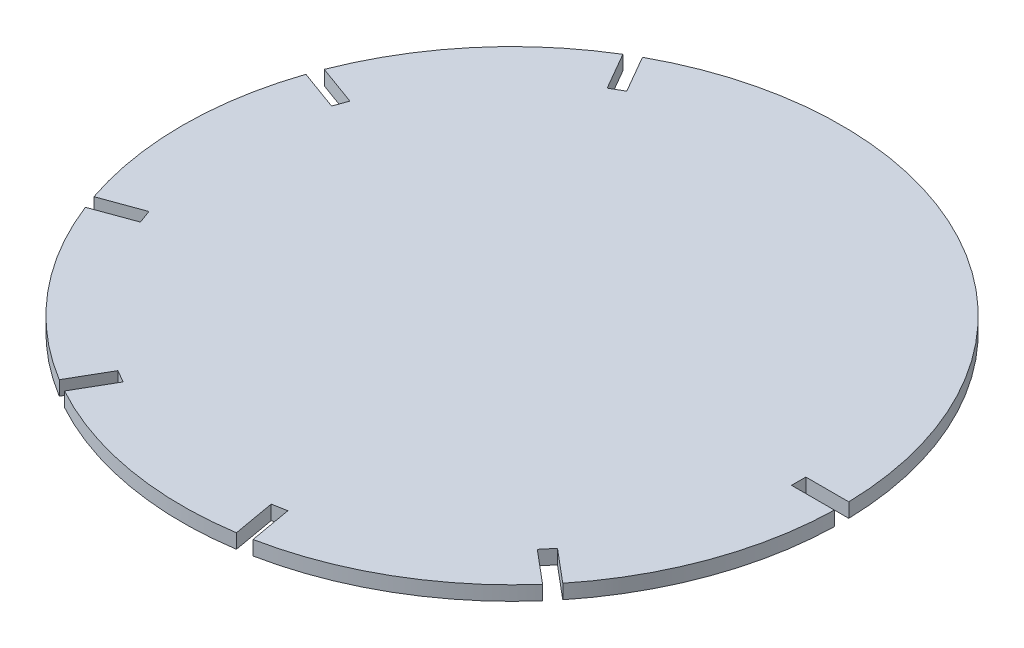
ISO-10303-21;
HEADER;
FILE_DESCRIPTION(('STEP AP214'),'2;1');
FILE_NAME('part.step','',(''),(''),'','','');
FILE_SCHEMA(('AUTOMOTIVE_DESIGN { 1 0 10303 214 1 1 1 1 }'));
ENDSEC;
DATA;
#1=APPLICATION_CONTEXT('core data for automotive mechanical design processes');
#2=APPLICATION_PROTOCOL_DEFINITION('international standard','automotive_design',2000,#1);
#3=PRODUCT_CONTEXT('',#1,'mechanical');
#4=PRODUCT('Part','Part','',(#3));
#5=PRODUCT_RELATED_PRODUCT_CATEGORY('part','',(#4));
#6=PRODUCT_DEFINITION_FORMATION('','',#4);
#7=PRODUCT_DEFINITION_CONTEXT('part definition',#1,'design');
#8=PRODUCT_DEFINITION('design','',#6,#7);
#9=PRODUCT_DEFINITION_SHAPE('','',#8);
#10=(LENGTH_UNIT() NAMED_UNIT(*) SI_UNIT(.MILLI.,.METRE.));
#11=(NAMED_UNIT(*) PLANE_ANGLE_UNIT() SI_UNIT($,.RADIAN.));
#12=(NAMED_UNIT(*) SI_UNIT($,.STERADIAN.) SOLID_ANGLE_UNIT());
#13=UNCERTAINTY_MEASURE_WITH_UNIT(LENGTH_MEASURE(1.E-05),#10,'distance_accuracy_value','');
#14=(GEOMETRIC_REPRESENTATION_CONTEXT(3) GLOBAL_UNCERTAINTY_ASSIGNED_CONTEXT((#13)) GLOBAL_UNIT_ASSIGNED_CONTEXT((#10,
#11,#12)) REPRESENTATION_CONTEXT('',''));
#15=CARTESIAN_POINT('',(0.,0.,0.));
#16=DIRECTION('',(0.,0.,1.));
#17=DIRECTION('',(1.,0.,0.));
#18=AXIS2_PLACEMENT_3D('',#15,#16,#17);
#19=CARTESIAN_POINT('',(0.,15.,0.));
#20=DIRECTION('',(0.,-1.,0.));
#21=DIRECTION('',(0.,0.,-1.));
#22=AXIS2_PLACEMENT_3D('',#19,#20,#21);
#23=CYLINDRICAL_SURFACE('',#22,345.);
#24=DIRECTION('',(0.,-1.,0.));
#25=VECTOR('',#24,1.);
#26=CARTESIAN_POINT('',(-165.964043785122,15.,302.458156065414));
#27=LINE('',#26,#25);
#28=CARTESIAN_POINT('',(-165.964043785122,0.,302.458156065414));
#29=VERTEX_POINT('',#28);
#30=CARTESIAN_POINT('',(-165.964043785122,15.,302.458156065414));
#31=VERTEX_POINT('',#30);
#32=EDGE_CURVE('E239',#29,#31,#27,.F.);
#33=ORIENTED_EDGE('',*,*,#32,.F.);
#34=CARTESIAN_POINT('',(0.,0.,0.));
#35=DIRECTION('',(0.,1.,0.));
#36=DIRECTION('',(0.,0.,1.));
#37=AXIS2_PLACEMENT_3D('',#34,#35,#36);
#38=CIRCLE('',#37,345.);
#39=CARTESIAN_POINT('',(52.5084053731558,0.,340.980743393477));
#40=VERTEX_POINT('',#39);
#41=EDGE_CURVE('E414',#29,#40,#38,.T.);
#42=ORIENTED_EDGE('',*,*,#41,.T.);
#43=DIRECTION('',(0.,-1.,0.));
#44=VECTOR('',#43,1.);
#45=CARTESIAN_POINT('',(52.5084053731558,15.,340.980743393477));
#46=LINE('',#45,#44);
#47=CARTESIAN_POINT('',(52.5084053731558,15.,340.980743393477));
#48=VERTEX_POINT('',#47);
#49=EDGE_CURVE('E368',#40,#48,#46,.F.);
#50=ORIENTED_EDGE('',*,*,#49,.T.);
#51=CARTESIAN_POINT('',(0.,15.,0.));
#52=DIRECTION('',(0.,1.,0.));
#53=DIRECTION('',(0.,0.,1.));
#54=AXIS2_PLACEMENT_3D('',#51,#52,#53);
#55=CIRCLE('',#54,345.);
#56=EDGE_CURVE('E42',#31,#48,#55,.T.);
#57=ORIENTED_EDGE('',*,*,#56,.F.);
#58=EDGE_LOOP('',(#33,#42,#50,#57));
#59=FACE_BOUND('',#58,.T.);
#60=ADVANCED_FACE('F33',(#59),#23,.T.);
#61=DIRECTION('',(0.,-1.,0.));
#62=VECTOR('',#61,1.);
#63=CARTESIAN_POINT('',(67.2805216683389,15.,338.376020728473));
#64=LINE('',#63,#62);
#65=CARTESIAN_POINT('',(67.2805216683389,0.,338.376020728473));
#66=VERTEX_POINT('',#65);
#67=CARTESIAN_POINT('',(67.2805216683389,15.,338.376020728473));
#68=VERTEX_POINT('',#67);
#69=EDGE_CURVE('E371',#66,#68,#64,.F.);
#70=ORIENTED_EDGE('',*,*,#69,.F.);
#71=CARTESIAN_POINT('',(259.401969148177,0.,227.454651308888));
#72=VERTEX_POINT('',#71);
#73=EDGE_CURVE('E419',#66,#72,#38,.T.);
#74=ORIENTED_EDGE('',*,*,#73,.T.);
#75=DIRECTION('',(0.,-1.,0.));
#76=VECTOR('',#75,1.);
#77=CARTESIAN_POINT('',(259.401969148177,15.,227.454651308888));
#78=LINE('',#77,#76);
#79=CARTESIAN_POINT('',(259.401969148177,15.,227.454651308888));
#80=VERTEX_POINT('',#79);
#81=EDGE_CURVE('E363',#72,#80,#78,.F.);
#82=ORIENTED_EDGE('',*,*,#81,.T.);
#83=EDGE_CURVE('E454',#68,#80,#55,.T.);
#84=ORIENTED_EDGE('',*,*,#83,.F.);
#85=EDGE_LOOP('',(#70,#74,#82,#84));
#86=FACE_BOUND('',#85,.T.);
#87=ADVANCED_FACE('F492',(#86),#23,.T.);
#88=DIRECTION('',(0.,-1.,0.));
#89=VECTOR('',#88,1.);
#90=CARTESIAN_POINT('',(269.043783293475,15.,215.963984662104));
#91=LINE('',#90,#89);
#92=CARTESIAN_POINT('',(269.043783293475,0.,215.963984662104));
#93=VERTEX_POINT('',#92);
#94=CARTESIAN_POINT('',(269.043783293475,15.,215.963984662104));
#95=VERTEX_POINT('',#94);
#96=EDGE_CURVE('E366',#93,#95,#91,.F.);
#97=ORIENTED_EDGE('',*,*,#96,.F.);
#98=CARTESIAN_POINT('',(344.918468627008,0.,7.5));
#99=VERTEX_POINT('',#98);
#100=EDGE_CURVE('E423',#93,#99,#38,.T.);
#101=ORIENTED_EDGE('',*,*,#100,.T.);
#102=DIRECTION('',(0.,-1.,0.));
#103=VECTOR('',#102,1.);
#104=CARTESIAN_POINT('',(344.918468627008,15.,7.5));
#105=LINE('',#104,#103);
#106=CARTESIAN_POINT('',(344.918468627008,15.,7.5));
#107=VERTEX_POINT('',#106);
#108=EDGE_CURVE('E358',#99,#107,#105,.F.);
#109=ORIENTED_EDGE('',*,*,#108,.T.);
#110=EDGE_CURVE('E452',#95,#107,#55,.T.);
#111=ORIENTED_EDGE('',*,*,#110,.F.);
#112=EDGE_LOOP('',(#97,#101,#109,#111));
#113=FACE_BOUND('',#112,.T.);
#114=ADVANCED_FACE('F505',(#113),#23,.T.);
#115=DIRECTION('',(0.,-1.,0.));
#116=VECTOR('',#115,1.);
#117=CARTESIAN_POINT('',(344.918468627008,15.,-7.5));
#118=LINE('',#117,#116);
#119=CARTESIAN_POINT('',(344.918468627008,0.,-7.5));
#120=VERTEX_POINT('',#119);
#121=CARTESIAN_POINT('',(344.918468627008,15.,-7.5));
#122=VERTEX_POINT('',#121);
#123=EDGE_CURVE('E361',#120,#122,#118,.F.);
#124=ORIENTED_EDGE('',*,*,#123,.F.);
#125=CARTESIAN_POINT('',(-165.964043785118,0.,-302.458156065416));
#126=VERTEX_POINT('',#125);
#127=EDGE_CURVE('E412',#120,#126,#38,.T.);
#128=ORIENTED_EDGE('',*,*,#127,.T.);
#129=DIRECTION('',(0.,-1.,0.));
#130=VECTOR('',#129,1.);
#131=CARTESIAN_POINT('',(-165.964043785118,15.,-302.458156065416));
#132=LINE('',#131,#130);
#133=CARTESIAN_POINT('',(-165.964043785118,15.,-302.458156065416));
#134=VERTEX_POINT('',#133);
#135=EDGE_CURVE('E58',#126,#134,#132,.F.);
#136=ORIENTED_EDGE('',*,*,#135,.T.);
#137=EDGE_CURVE('E449',#122,#134,#55,.T.);
#138=ORIENTED_EDGE('',*,*,#137,.F.);
#139=EDGE_LOOP('',(#124,#128,#136,#138));
#140=FACE_BOUND('',#139,.T.);
#141=ADVANCED_FACE('F435',(#140),#23,.T.);
#142=DIRECTION('',(0.,-1.,0.));
#143=VECTOR('',#142,1.);
#144=CARTESIAN_POINT('',(-326.682490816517,15.,-110.921369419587));
#145=LINE('',#144,#143);
#146=CARTESIAN_POINT('',(-326.682490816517,0.,-110.921369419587));
#147=VERTEX_POINT('',#146);
#148=CARTESIAN_POINT('',(-326.682490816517,15.,-110.921369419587));
#149=VERTEX_POINT('',#148);
#150=EDGE_CURVE('E356',#147,#149,#145,.F.);
#151=ORIENTED_EDGE('',*,*,#150,.F.);
#152=CARTESIAN_POINT('',(-326.682490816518,0.,110.921369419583));
#153=VERTEX_POINT('',#152);
#154=EDGE_CURVE('E402',#147,#153,#38,.T.);
#155=ORIENTED_EDGE('',*,*,#154,.T.);
#156=DIRECTION('',(0.,-1.,0.));
#157=VECTOR('',#156,1.);
#158=CARTESIAN_POINT('',(-326.682490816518,15.,110.921369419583));
#159=LINE('',#158,#157);
#160=CARTESIAN_POINT('',(-326.682490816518,15.,110.921369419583));
#161=VERTEX_POINT('',#160);
#162=EDGE_CURVE('E397',#153,#161,#159,.F.);
#163=ORIENTED_EDGE('',*,*,#162,.T.);
#164=EDGE_CURVE('E43',#149,#161,#55,.T.);
#165=ORIENTED_EDGE('',*,*,#164,.F.);
#166=EDGE_LOOP('',(#151,#155,#163,#165));
#167=FACE_BOUND('',#166,.T.);
#168=ADVANCED_FACE('F472',(#167),#23,.T.);
#169=CARTESIAN_POINT('',(-178.954424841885,0.,-294.958156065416));
#170=VERTEX_POINT('',#169);
#171=CARTESIAN_POINT('',(-321.552188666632,0.,-125.016758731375));
#172=VERTEX_POINT('',#171);
#173=EDGE_CURVE('E406',#170,#172,#38,.T.);
#174=ORIENTED_EDGE('',*,*,#173,.T.);
#175=DIRECTION('',(0.,-1.,0.));
#176=VECTOR('',#175,1.);
#177=CARTESIAN_POINT('',(-321.552188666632,15.,-125.016758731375));
#178=LINE('',#177,#176);
#179=CARTESIAN_POINT('',(-321.552188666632,15.,-125.016758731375));
#180=VERTEX_POINT('',#179);
#181=EDGE_CURVE('E50',#172,#180,#178,.F.);
#182=ORIENTED_EDGE('',*,*,#181,.T.);
#183=CARTESIAN_POINT('',(-178.954424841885,15.,-294.958156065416));
#184=VERTEX_POINT('',#183);
#185=EDGE_CURVE('E417',#184,#180,#55,.T.);
#186=ORIENTED_EDGE('',*,*,#185,.F.);
#187=DIRECTION('',(0.,-1.,0.));
#188=VECTOR('',#187,1.);
#189=CARTESIAN_POINT('',(-178.954424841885,15.,-294.958156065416));
#190=LINE('',#189,#188);
#191=EDGE_CURVE('E247',#170,#184,#190,.F.);
#192=ORIENTED_EDGE('',*,*,#191,.F.);
#193=EDGE_LOOP('',(#174,#182,#186,#192));
#194=FACE_BOUND('',#193,.T.);
#195=ADVANCED_FACE('F461',(#194),#23,.T.);
#196=CARTESIAN_POINT('',(0.,15.,0.));
#197=DIRECTION('',(0.,1.,0.));
#198=DIRECTION('',(0.,0.,1.));
#199=AXIS2_PLACEMENT_3D('',#196,#197,#198);
#200=PLANE('',#199);
#201=DIRECTION('',(-0.866025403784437,0.,-0.500000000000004));
#202=VECTOR('',#201,1.);
#203=CARTESIAN_POINT('',(-143.504809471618,15.,263.557621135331));
#204=LINE('',#203,#202);
#205=CARTESIAN_POINT('',(-143.504809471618,15.,263.557621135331));
#206=VERTEX_POINT('',#205);
#207=CARTESIAN_POINT('',(-156.495190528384,15.,256.057621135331));
#208=VERTEX_POINT('',#207);
#209=EDGE_CURVE('E226',#206,#208,#204,.T.);
#210=ORIENTED_EDGE('',*,*,#209,.F.);
#211=DIRECTION('',(-0.500000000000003,0.,0.866025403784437));
#212=VECTOR('',#211,1.);
#213=CARTESIAN_POINT('',(-143.504809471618,15.,263.557621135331));
#214=LINE('',#213,#212);
#215=EDGE_CURVE('E236',#206,#31,#214,.T.);
#216=ORIENTED_EDGE('',*,*,#215,.T.);
#217=ORIENTED_EDGE('',*,*,#56,.T.);
#218=DIRECTION('',(0.173648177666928,0.,0.984807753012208));
#219=VECTOR('',#218,1.);
#220=CARTESIAN_POINT('',(44.7083951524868,15.,296.744687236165));
#221=LINE('',#220,#219);
#222=CARTESIAN_POINT('',(44.7083951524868,15.,296.744687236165));
#223=VERTEX_POINT('',#222);
#224=EDGE_CURVE('E266',#223,#48,#221,.T.);
#225=ORIENTED_EDGE('',*,*,#224,.F.);
#226=DIRECTION('',(-0.984807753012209,0.,0.173648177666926));
#227=VECTOR('',#226,1.);
#228=CARTESIAN_POINT('',(59.48051144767,15.,294.139964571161));
#229=LINE('',#228,#227);
#230=CARTESIAN_POINT('',(59.48051144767,15.,294.139964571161));
#231=VERTEX_POINT('',#230);
#232=EDGE_CURVE('E233',#231,#223,#229,.T.);
#233=ORIENTED_EDGE('',*,*,#232,.F.);
#234=DIRECTION('',(0.173648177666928,0.,0.984807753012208));
#235=VECTOR('',#234,1.);
#236=CARTESIAN_POINT('',(59.48051144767,15.,294.139964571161));
#237=LINE('',#236,#235);
#238=EDGE_CURVE('E263',#231,#68,#237,.T.);
#239=ORIENTED_EDGE('',*,*,#238,.T.);
#240=ORIENTED_EDGE('',*,*,#83,.T.);
#241=DIRECTION('',(0.766044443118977,0.,0.64278760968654));
#242=VECTOR('',#241,1.);
#243=CARTESIAN_POINT('',(224.992425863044,15.,198.581616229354));
#244=LINE('',#243,#242);
#245=CARTESIAN_POINT('',(224.992425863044,15.,198.581616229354));
#246=VERTEX_POINT('',#245);
#247=EDGE_CURVE('E286',#246,#80,#244,.T.);
#248=ORIENTED_EDGE('',*,*,#247,.F.);
#249=DIRECTION('',(-0.642787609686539,0.,0.766044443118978));
#250=VECTOR('',#249,1.);
#251=CARTESIAN_POINT('',(234.634240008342,15.,187.09094958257));
#252=LINE('',#251,#250);
#253=CARTESIAN_POINT('',(234.634240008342,15.,187.09094958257));
#254=VERTEX_POINT('',#253);
#255=EDGE_CURVE('E262',#254,#246,#252,.T.);
#256=ORIENTED_EDGE('',*,*,#255,.F.);
#257=DIRECTION('',(0.766044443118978,0.,0.64278760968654));
#258=VECTOR('',#257,1.);
#259=CARTESIAN_POINT('',(234.634240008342,15.,187.09094958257));
#260=LINE('',#259,#258);
#261=EDGE_CURVE('E283',#254,#95,#260,.T.);
#262=ORIENTED_EDGE('',*,*,#261,.T.);
#263=ORIENTED_EDGE('',*,*,#110,.T.);
#264=DIRECTION('',(1.,0.,0.));
#265=VECTOR('',#264,1.);
#266=CARTESIAN_POINT('',(300.,15.,7.5));
#267=LINE('',#266,#265);
#268=CARTESIAN_POINT('',(300.,15.,7.5));
#269=VERTEX_POINT('',#268);
#270=EDGE_CURVE('E306',#269,#107,#267,.T.);
#271=ORIENTED_EDGE('',*,*,#270,.F.);
#272=DIRECTION('',(0.,0.,1.));
#273=VECTOR('',#272,1.);
#274=CARTESIAN_POINT('',(300.,15.,-7.5));
#275=LINE('',#274,#273);
#276=CARTESIAN_POINT('',(300.,15.,-7.5));
#277=VERTEX_POINT('',#276);
#278=EDGE_CURVE('E282',#277,#269,#275,.T.);
#279=ORIENTED_EDGE('',*,*,#278,.F.);
#280=DIRECTION('',(1.,0.,0.));
#281=VECTOR('',#280,1.);
#282=CARTESIAN_POINT('',(300.,15.,-7.5));
#283=LINE('',#282,#281);
#284=EDGE_CURVE('E303',#277,#122,#283,.T.);
#285=ORIENTED_EDGE('',*,*,#284,.T.);
#286=ORIENTED_EDGE('',*,*,#137,.T.);
#287=DIRECTION('',(-0.499999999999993,0.,-0.866025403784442));
#288=VECTOR('',#287,1.);
#289=CARTESIAN_POINT('',(-143.504809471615,15.,-263.557621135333));
#290=LINE('',#289,#288);
#291=CARTESIAN_POINT('',(-143.504809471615,15.,-263.557621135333));
#292=VERTEX_POINT('',#291);
#293=EDGE_CURVE('E344',#292,#134,#290,.T.);
#294=ORIENTED_EDGE('',*,*,#293,.F.);
#295=DIRECTION('',(0.866025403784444,0.,-0.49999999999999));
#296=VECTOR('',#295,1.);
#297=CARTESIAN_POINT('',(-156.495190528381,15.,-256.057621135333));
#298=LINE('',#297,#296);
#299=CARTESIAN_POINT('',(-156.495190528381,15.,-256.057621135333));
#300=VERTEX_POINT('',#299);
#301=EDGE_CURVE('E322',#300,#292,#298,.T.);
#302=ORIENTED_EDGE('',*,*,#301,.F.);
#303=DIRECTION('',(-0.499999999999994,0.,-0.866025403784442));
#304=VECTOR('',#303,1.);
#305=CARTESIAN_POINT('',(-156.495190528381,15.,-256.057621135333));
#306=LINE('',#305,#304);
#307=EDGE_CURVE('E341',#300,#184,#306,.T.);
#308=ORIENTED_EDGE('',*,*,#307,.T.);
#309=ORIENTED_EDGE('',*,*,#185,.T.);
#310=DIRECTION('',(-0.939692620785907,0.,-0.342020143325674));
#311=VECTOR('',#310,1.);
#312=CARTESIAN_POINT('',(-279.342635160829,15.,-109.653737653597));
#313=LINE('',#312,#311);
#314=CARTESIAN_POINT('',(-279.342635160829,15.,-109.653737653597));
#315=VERTEX_POINT('',#314);
#316=EDGE_CURVE('E326',#315,#180,#313,.T.);
#317=ORIENTED_EDGE('',*,*,#316,.F.);
#318=DIRECTION('',(0.342020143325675,0.,-0.939692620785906));
#319=VECTOR('',#318,1.);
#320=CARTESIAN_POINT('',(-284.472937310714,15.,-95.5583483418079));
#321=LINE('',#320,#319);
#322=CARTESIAN_POINT('',(-284.472937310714,15.,-95.5583483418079));
#323=VERTEX_POINT('',#322);
#324=EDGE_CURVE('E302',#323,#315,#321,.T.);
#325=ORIENTED_EDGE('',*,*,#324,.F.);
#326=DIRECTION('',(-0.939692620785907,0.,-0.342020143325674));
#327=VECTOR('',#326,1.);
#328=CARTESIAN_POINT('',(-284.472937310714,15.,-95.5583483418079));
#329=LINE('',#328,#327);
#330=EDGE_CURVE('E323',#323,#149,#329,.T.);
#331=ORIENTED_EDGE('',*,*,#330,.T.);
#332=ORIENTED_EDGE('',*,*,#164,.T.);
#333=DIRECTION('',(-0.93969262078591,0.,0.342020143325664));
#334=VECTOR('',#333,1.);
#335=CARTESIAN_POINT('',(-284.472937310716,15.,95.5583483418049));
#336=LINE('',#335,#334);
#337=CARTESIAN_POINT('',(-284.472937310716,15.,95.5583483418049));
#338=VERTEX_POINT('',#337);
#339=EDGE_CURVE('E390',#338,#161,#336,.T.);
#340=ORIENTED_EDGE('',*,*,#339,.F.);
#341=DIRECTION('',(-0.342020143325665,0.,-0.93969262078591));
#342=VECTOR('',#341,1.);
#343=CARTESIAN_POINT('',(-279.342635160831,15.,109.653737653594));
#344=LINE('',#343,#342);
#345=CARTESIAN_POINT('',(-279.342635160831,15.,109.653737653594));
#346=VERTEX_POINT('',#345);
#347=EDGE_CURVE('E377',#346,#338,#344,.T.);
#348=ORIENTED_EDGE('',*,*,#347,.F.);
#349=DIRECTION('',(-0.93969262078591,0.,0.342020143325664));
#350=VECTOR('',#349,1.);
#351=CARTESIAN_POINT('',(-279.342635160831,15.,109.653737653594));
#352=LINE('',#351,#350);
#353=CARTESIAN_POINT('',(-321.552188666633,15.,125.016758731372));
#354=VERTEX_POINT('',#353);
#355=EDGE_CURVE('E382',#346,#354,#352,.T.);
#356=ORIENTED_EDGE('',*,*,#355,.T.);
#357=CARTESIAN_POINT('',(-178.954424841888,15.,294.958156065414));
#358=VERTEX_POINT('',#357);
#359=EDGE_CURVE('E11',#354,#358,#55,.T.);
#360=ORIENTED_EDGE('',*,*,#359,.T.);
#361=DIRECTION('',(-0.500000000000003,0.,0.866025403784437));
#362=VECTOR('',#361,1.);
#363=CARTESIAN_POINT('',(-156.495190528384,15.,256.057621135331));
#364=LINE('',#363,#362);
#365=EDGE_CURVE('E243',#208,#358,#364,.T.);
#366=ORIENTED_EDGE('',*,*,#365,.F.);
#367=EDGE_LOOP('',(#210,#216,#217,#225,#233,#239,#240,#248,#256,#262,#263,#271,#279,#285,#286,
#294,#302,#308,#309,#317,#325,#331,#332,#340,#348,#356,#360,#366));
#368=FACE_BOUND('',#367,.T.);
#369=ADVANCED_FACE('F245',(#368),#200,.T.);
#370=CARTESIAN_POINT('',(0.,0.,0.));
#371=DIRECTION('',(0.,1.,0.));
#372=DIRECTION('',(0.,0.,1.));
#373=AXIS2_PLACEMENT_3D('',#370,#371,#372);
#374=PLANE('',#373);
#375=DIRECTION('',(-0.500000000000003,0.,0.866025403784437));
#376=VECTOR('',#375,1.);
#377=CARTESIAN_POINT('',(-143.504809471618,0.,263.557621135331));
#378=LINE('',#377,#376);
#379=CARTESIAN_POINT('',(-143.504809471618,0.,263.557621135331));
#380=VERTEX_POINT('',#379);
#381=EDGE_CURVE('E251',#380,#29,#378,.T.);
#382=ORIENTED_EDGE('',*,*,#381,.F.);
#383=DIRECTION('',(-0.866025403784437,0.,-0.500000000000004));
#384=VECTOR('',#383,1.);
#385=CARTESIAN_POINT('',(-143.504809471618,0.,263.557621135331));
#386=LINE('',#385,#384);
#387=CARTESIAN_POINT('',(-156.495190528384,0.,256.057621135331));
#388=VERTEX_POINT('',#387);
#389=EDGE_CURVE('E229',#380,#388,#386,.T.);
#390=ORIENTED_EDGE('',*,*,#389,.T.);
#391=DIRECTION('',(-0.500000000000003,0.,0.866025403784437));
#392=VECTOR('',#391,1.);
#393=CARTESIAN_POINT('',(-156.495190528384,0.,256.057621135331));
#394=LINE('',#393,#392);
#395=CARTESIAN_POINT('',(-178.954424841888,0.,294.958156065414));
#396=VERTEX_POINT('',#395);
#397=EDGE_CURVE('E253',#388,#396,#394,.T.);
#398=ORIENTED_EDGE('',*,*,#397,.T.);
#399=CARTESIAN_POINT('',(-321.552188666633,0.,125.016758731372));
#400=VERTEX_POINT('',#399);
#401=EDGE_CURVE('E37',#400,#396,#38,.T.);
#402=ORIENTED_EDGE('',*,*,#401,.F.);
#403=DIRECTION('',(-0.93969262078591,0.,0.342020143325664));
#404=VECTOR('',#403,1.);
#405=CARTESIAN_POINT('',(-279.342635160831,0.,109.653737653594));
#406=LINE('',#405,#404);
#407=CARTESIAN_POINT('',(-279.342635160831,0.,109.653737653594));
#408=VERTEX_POINT('',#407);
#409=EDGE_CURVE('E385',#408,#400,#406,.T.);
#410=ORIENTED_EDGE('',*,*,#409,.F.);
#411=DIRECTION('',(-0.342020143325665,0.,-0.93969262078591));
#412=VECTOR('',#411,1.);
#413=CARTESIAN_POINT('',(-279.342635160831,0.,109.653737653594));
#414=LINE('',#413,#412);
#415=CARTESIAN_POINT('',(-284.472937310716,0.,95.5583483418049));
#416=VERTEX_POINT('',#415);
#417=EDGE_CURVE('E378',#408,#416,#414,.T.);
#418=ORIENTED_EDGE('',*,*,#417,.T.);
#419=DIRECTION('',(-0.93969262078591,0.,0.342020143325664));
#420=VECTOR('',#419,1.);
#421=CARTESIAN_POINT('',(-284.472937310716,0.,95.5583483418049));
#422=LINE('',#421,#420);
#423=EDGE_CURVE('E381',#416,#153,#422,.T.);
#424=ORIENTED_EDGE('',*,*,#423,.T.);
#425=ORIENTED_EDGE('',*,*,#154,.F.);
#426=DIRECTION('',(-0.939692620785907,0.,-0.342020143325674));
#427=VECTOR('',#426,1.);
#428=CARTESIAN_POINT('',(-284.472937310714,0.,-95.5583483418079));
#429=LINE('',#428,#427);
#430=CARTESIAN_POINT('',(-284.472937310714,0.,-95.5583483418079));
#431=VERTEX_POINT('',#430);
#432=EDGE_CURVE('E319',#431,#147,#429,.T.);
#433=ORIENTED_EDGE('',*,*,#432,.F.);
#434=DIRECTION('',(0.342020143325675,0.,-0.939692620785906));
#435=VECTOR('',#434,1.);
#436=CARTESIAN_POINT('',(-284.472937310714,0.,-95.5583483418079));
#437=LINE('',#436,#435);
#438=CARTESIAN_POINT('',(-279.342635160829,0.,-109.653737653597));
#439=VERTEX_POINT('',#438);
#440=EDGE_CURVE('E327',#431,#439,#437,.T.);
#441=ORIENTED_EDGE('',*,*,#440,.T.);
#442=DIRECTION('',(-0.939692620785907,0.,-0.342020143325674));
#443=VECTOR('',#442,1.);
#444=CARTESIAN_POINT('',(-279.342635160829,0.,-109.653737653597));
#445=LINE('',#444,#443);
#446=EDGE_CURVE('E332',#439,#172,#445,.T.);
#447=ORIENTED_EDGE('',*,*,#446,.T.);
#448=ORIENTED_EDGE('',*,*,#173,.F.);
#449=DIRECTION('',(-0.499999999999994,0.,-0.866025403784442));
#450=VECTOR('',#449,1.);
#451=CARTESIAN_POINT('',(-156.495190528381,0.,-256.057621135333));
#452=LINE('',#451,#450);
#453=CARTESIAN_POINT('',(-156.495190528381,0.,-256.057621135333));
#454=VERTEX_POINT('',#453);
#455=EDGE_CURVE('E338',#454,#170,#452,.T.);
#456=ORIENTED_EDGE('',*,*,#455,.F.);
#457=DIRECTION('',(0.866025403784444,0.,-0.49999999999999));
#458=VECTOR('',#457,1.);
#459=CARTESIAN_POINT('',(-156.495190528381,0.,-256.057621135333));
#460=LINE('',#459,#458);
#461=CARTESIAN_POINT('',(-143.504809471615,0.,-263.557621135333));
#462=VERTEX_POINT('',#461);
#463=EDGE_CURVE('E345',#454,#462,#460,.T.);
#464=ORIENTED_EDGE('',*,*,#463,.T.);
#465=DIRECTION('',(-0.499999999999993,0.,-0.866025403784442));
#466=VECTOR('',#465,1.);
#467=CARTESIAN_POINT('',(-143.504809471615,0.,-263.557621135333));
#468=LINE('',#467,#466);
#469=EDGE_CURVE('E350',#462,#126,#468,.T.);
#470=ORIENTED_EDGE('',*,*,#469,.T.);
#471=ORIENTED_EDGE('',*,*,#127,.F.);
#472=DIRECTION('',(1.,0.,0.));
#473=VECTOR('',#472,1.);
#474=CARTESIAN_POINT('',(300.,0.,-7.5));
#475=LINE('',#474,#473);
#476=CARTESIAN_POINT('',(300.,0.,-7.5));
#477=VERTEX_POINT('',#476);
#478=EDGE_CURVE('E299',#477,#120,#475,.T.);
#479=ORIENTED_EDGE('',*,*,#478,.F.);
#480=DIRECTION('',(0.,0.,1.));
#481=VECTOR('',#480,1.);
#482=CARTESIAN_POINT('',(300.,0.,-7.5));
#483=LINE('',#482,#481);
#484=CARTESIAN_POINT('',(300.,0.,7.5));
#485=VERTEX_POINT('',#484);
#486=EDGE_CURVE('E307',#477,#485,#483,.T.);
#487=ORIENTED_EDGE('',*,*,#486,.T.);
#488=DIRECTION('',(1.,0.,0.));
#489=VECTOR('',#488,1.);
#490=CARTESIAN_POINT('',(300.,0.,7.5));
#491=LINE('',#490,#489);
#492=EDGE_CURVE('E312',#485,#99,#491,.T.);
#493=ORIENTED_EDGE('',*,*,#492,.T.);
#494=ORIENTED_EDGE('',*,*,#100,.F.);
#495=DIRECTION('',(0.766044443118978,0.,0.64278760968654));
#496=VECTOR('',#495,1.);
#497=CARTESIAN_POINT('',(234.634240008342,0.,187.09094958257));
#498=LINE('',#497,#496);
#499=CARTESIAN_POINT('',(234.634240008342,0.,187.09094958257));
#500=VERTEX_POINT('',#499);
#501=EDGE_CURVE('E279',#500,#93,#498,.T.);
#502=ORIENTED_EDGE('',*,*,#501,.F.);
#503=DIRECTION('',(-0.642787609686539,0.,0.766044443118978));
#504=VECTOR('',#503,1.);
#505=CARTESIAN_POINT('',(234.634240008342,0.,187.09094958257));
#506=LINE('',#505,#504);
#507=CARTESIAN_POINT('',(224.992425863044,0.,198.581616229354));
#508=VERTEX_POINT('',#507);
#509=EDGE_CURVE('E287',#500,#508,#506,.T.);
#510=ORIENTED_EDGE('',*,*,#509,.T.);
#511=DIRECTION('',(0.766044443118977,0.,0.64278760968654));
#512=VECTOR('',#511,1.);
#513=CARTESIAN_POINT('',(224.992425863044,0.,198.581616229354));
#514=LINE('',#513,#512);
#515=EDGE_CURVE('E292',#508,#72,#514,.T.);
#516=ORIENTED_EDGE('',*,*,#515,.T.);
#517=ORIENTED_EDGE('',*,*,#73,.F.);
#518=DIRECTION('',(0.173648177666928,0.,0.984807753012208));
#519=VECTOR('',#518,1.);
#520=CARTESIAN_POINT('',(59.48051144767,0.,294.139964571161));
#521=LINE('',#520,#519);
#522=CARTESIAN_POINT('',(59.48051144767,0.,294.139964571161));
#523=VERTEX_POINT('',#522);
#524=EDGE_CURVE('E259',#523,#66,#521,.T.);
#525=ORIENTED_EDGE('',*,*,#524,.F.);
#526=DIRECTION('',(-0.984807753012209,0.,0.173648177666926));
#527=VECTOR('',#526,1.);
#528=CARTESIAN_POINT('',(59.48051144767,0.,294.139964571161));
#529=LINE('',#528,#527);
#530=CARTESIAN_POINT('',(44.7083951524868,0.,296.744687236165));
#531=VERTEX_POINT('',#530);
#532=EDGE_CURVE('E267',#523,#531,#529,.T.);
#533=ORIENTED_EDGE('',*,*,#532,.T.);
#534=DIRECTION('',(0.173648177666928,0.,0.984807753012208));
#535=VECTOR('',#534,1.);
#536=CARTESIAN_POINT('',(44.7083951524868,0.,296.744687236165));
#537=LINE('',#536,#535);
#538=EDGE_CURVE('E272',#531,#40,#537,.T.);
#539=ORIENTED_EDGE('',*,*,#538,.T.);
#540=ORIENTED_EDGE('',*,*,#41,.F.);
#541=EDGE_LOOP('',(#382,#390,#398,#402,#410,#418,#424,#425,#433,#441,#447,#448,#456,#464,#470,
#471,#479,#487,#493,#494,#502,#510,#516,#517,#525,#533,#539,#540));
#542=FACE_BOUND('',#541,.T.);
#543=ADVANCED_FACE('F440',(#542),#374,.F.);
#544=ORIENTED_EDGE('',*,*,#401,.T.);
#545=DIRECTION('',(0.,-1.,0.));
#546=VECTOR('',#545,1.);
#547=CARTESIAN_POINT('',(-178.954424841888,15.,294.958156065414));
#548=LINE('',#547,#546);
#549=EDGE_CURVE('E373',#396,#358,#548,.F.);
#550=ORIENTED_EDGE('',*,*,#549,.T.);
#551=ORIENTED_EDGE('',*,*,#359,.F.);
#552=DIRECTION('',(0.,-1.,0.));
#553=VECTOR('',#552,1.);
#554=CARTESIAN_POINT('',(-321.552188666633,15.,125.016758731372));
#555=LINE('',#554,#553);
#556=EDGE_CURVE('E401',#400,#354,#555,.F.);
#557=ORIENTED_EDGE('',*,*,#556,.F.);
#558=EDGE_LOOP('',(#544,#550,#551,#557));
#559=FACE_BOUND('',#558,.T.);
#560=ADVANCED_FACE('F35',(#559),#23,.T.);
#561=CARTESIAN_POINT('',(-279.342635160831,0.,109.653737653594));
#562=DIRECTION('',(-0.342020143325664,0.,-0.93969262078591));
#563=DIRECTION('',(-0.93969262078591,0.,0.342020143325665));
#564=AXIS2_PLACEMENT_3D('',#561,#562,#563);
#565=PLANE('',#564);
#566=ORIENTED_EDGE('',*,*,#556,.T.);
#567=ORIENTED_EDGE('',*,*,#355,.F.);
#568=DIRECTION('',(0.,1.,0.));
#569=VECTOR('',#568,1.);
#570=CARTESIAN_POINT('',(-279.342635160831,0.,109.653737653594));
#571=LINE('',#570,#569);
#572=EDGE_CURVE('E395',#408,#346,#571,.T.);
#573=ORIENTED_EDGE('',*,*,#572,.F.);
#574=ORIENTED_EDGE('',*,*,#409,.T.);
#575=EDGE_LOOP('',(#566,#567,#573,#574));
#576=FACE_BOUND('',#575,.T.);
#577=ADVANCED_FACE('F527',(#576),#565,.T.);
#578=CARTESIAN_POINT('',(-284.472937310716,0.,95.5583483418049));
#579=DIRECTION('',(-0.342020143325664,0.,-0.93969262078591));
#580=DIRECTION('',(-0.93969262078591,0.,0.342020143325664));
#581=AXIS2_PLACEMENT_3D('',#578,#579,#580);
#582=PLANE('',#581);
#583=ORIENTED_EDGE('',*,*,#423,.F.);
#584=DIRECTION('',(0.,1.,0.));
#585=VECTOR('',#584,1.);
#586=CARTESIAN_POINT('',(-284.472937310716,0.,95.5583483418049));
#587=LINE('',#586,#585);
#588=EDGE_CURVE('E387',#416,#338,#587,.T.);
#589=ORIENTED_EDGE('',*,*,#588,.T.);
#590=ORIENTED_EDGE('',*,*,#339,.T.);
#591=ORIENTED_EDGE('',*,*,#162,.F.);
#592=EDGE_LOOP('',(#583,#589,#590,#591));
#593=FACE_BOUND('',#592,.T.);
#594=ADVANCED_FACE('F475',(#593),#582,.F.);
#595=CARTESIAN_POINT('',(-279.342635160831,0.,109.653737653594));
#596=DIRECTION('',(0.93969262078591,0.,-0.342020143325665));
#597=DIRECTION('',(-0.342020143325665,0.,-0.93969262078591));
#598=AXIS2_PLACEMENT_3D('',#595,#596,#597);
#599=PLANE('',#598);
#600=ORIENTED_EDGE('',*,*,#347,.T.);
#601=ORIENTED_EDGE('',*,*,#588,.F.);
#602=ORIENTED_EDGE('',*,*,#417,.F.);
#603=ORIENTED_EDGE('',*,*,#572,.T.);
#604=EDGE_LOOP('',(#600,#601,#602,#603));
#605=FACE_BOUND('',#604,.T.);
#606=ADVANCED_FACE('F479',(#605),#599,.F.);
#607=CARTESIAN_POINT('',(-156.495190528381,0.,-256.057621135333));
#608=DIRECTION('',(0.866025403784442,0.,-0.499999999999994));
#609=DIRECTION('',(-0.499999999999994,0.,-0.866025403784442));
#610=AXIS2_PLACEMENT_3D('',#607,#608,#609);
#611=PLANE('',#610);
#612=ORIENTED_EDGE('',*,*,#191,.T.);
#613=ORIENTED_EDGE('',*,*,#307,.F.);
#614=DIRECTION('',(0.,1.,0.));
#615=VECTOR('',#614,1.);
#616=CARTESIAN_POINT('',(-156.495190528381,0.,-256.057621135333));
#617=LINE('',#616,#615);
#618=EDGE_CURVE('E339',#454,#300,#617,.T.);
#619=ORIENTED_EDGE('',*,*,#618,.F.);
#620=ORIENTED_EDGE('',*,*,#455,.T.);
#621=EDGE_LOOP('',(#612,#613,#619,#620));
#622=FACE_BOUND('',#621,.T.);
#623=ADVANCED_FACE('F577',(#622),#611,.T.);
#624=CARTESIAN_POINT('',(-143.504809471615,0.,-263.557621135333));
#625=DIRECTION('',(0.866025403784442,0.,-0.499999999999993));
#626=DIRECTION('',(-0.499999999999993,0.,-0.866025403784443));
#627=AXIS2_PLACEMENT_3D('',#624,#625,#626);
#628=PLANE('',#627);
#629=ORIENTED_EDGE('',*,*,#469,.F.);
#630=DIRECTION('',(0.,1.,0.));
#631=VECTOR('',#630,1.);
#632=CARTESIAN_POINT('',(-143.504809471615,0.,-263.557621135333));
#633=LINE('',#632,#631);
#634=EDGE_CURVE('E336',#462,#292,#633,.T.);
#635=ORIENTED_EDGE('',*,*,#634,.T.);
#636=ORIENTED_EDGE('',*,*,#293,.T.);
#637=ORIENTED_EDGE('',*,*,#135,.F.);
#638=EDGE_LOOP('',(#629,#635,#636,#637));
#639=FACE_BOUND('',#638,.T.);
#640=ADVANCED_FACE('F443',(#639),#628,.F.);
#641=CARTESIAN_POINT('',(-156.495190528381,0.,-256.057621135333));
#642=DIRECTION('',(0.49999999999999,0.,0.866025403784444));
#643=DIRECTION('',(0.866025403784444,0.,-0.49999999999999));
#644=AXIS2_PLACEMENT_3D('',#641,#642,#643);
#645=PLANE('',#644);
#646=ORIENTED_EDGE('',*,*,#301,.T.);
#647=ORIENTED_EDGE('',*,*,#634,.F.);
#648=ORIENTED_EDGE('',*,*,#463,.F.);
#649=ORIENTED_EDGE('',*,*,#618,.T.);
#650=EDGE_LOOP('',(#646,#647,#648,#649));
#651=FACE_BOUND('',#650,.T.);
#652=ADVANCED_FACE('F447',(#651),#645,.F.);
#653=CARTESIAN_POINT('',(-284.472937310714,0.,-95.5583483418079));
#654=DIRECTION('',(0.342020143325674,0.,-0.939692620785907));
#655=DIRECTION('',(-0.939692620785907,0.,-0.342020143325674));
#656=AXIS2_PLACEMENT_3D('',#653,#654,#655);
#657=PLANE('',#656);
#658=ORIENTED_EDGE('',*,*,#150,.T.);
#659=ORIENTED_EDGE('',*,*,#330,.F.);
#660=DIRECTION('',(0.,1.,0.));
#661=VECTOR('',#660,1.);
#662=CARTESIAN_POINT('',(-284.472937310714,0.,-95.5583483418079));
#663=LINE('',#662,#661);
#664=EDGE_CURVE('E320',#431,#323,#663,.T.);
#665=ORIENTED_EDGE('',*,*,#664,.F.);
#666=ORIENTED_EDGE('',*,*,#432,.T.);
#667=EDGE_LOOP('',(#658,#659,#665,#666));
#668=FACE_BOUND('',#667,.T.);
#669=ADVANCED_FACE('F600',(#668),#657,.T.);
#670=CARTESIAN_POINT('',(-279.342635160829,0.,-109.653737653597));
#671=DIRECTION('',(0.342020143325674,0.,-0.939692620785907));
#672=DIRECTION('',(-0.939692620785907,0.,-0.342020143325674));
#673=AXIS2_PLACEMENT_3D('',#670,#671,#672);
#674=PLANE('',#673);
#675=ORIENTED_EDGE('',*,*,#446,.F.);
#676=DIRECTION('',(0.,1.,0.));
#677=VECTOR('',#676,1.);
#678=CARTESIAN_POINT('',(-279.342635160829,0.,-109.653737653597));
#679=LINE('',#678,#677);
#680=EDGE_CURVE('E317',#439,#315,#679,.T.);
#681=ORIENTED_EDGE('',*,*,#680,.T.);
#682=ORIENTED_EDGE('',*,*,#316,.T.);
#683=ORIENTED_EDGE('',*,*,#181,.F.);
#684=EDGE_LOOP('',(#675,#681,#682,#683));
#685=FACE_BOUND('',#684,.T.);
#686=ADVANCED_FACE('F465',(#685),#674,.F.);
#687=CARTESIAN_POINT('',(-284.472937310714,0.,-95.5583483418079));
#688=DIRECTION('',(0.939692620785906,0.,0.342020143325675));
#689=DIRECTION('',(0.342020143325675,0.,-0.939692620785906));
#690=AXIS2_PLACEMENT_3D('',#687,#688,#689);
#691=PLANE('',#690);
#692=ORIENTED_EDGE('',*,*,#324,.T.);
#693=ORIENTED_EDGE('',*,*,#680,.F.);
#694=ORIENTED_EDGE('',*,*,#440,.F.);
#695=ORIENTED_EDGE('',*,*,#664,.T.);
#696=EDGE_LOOP('',(#692,#693,#694,#695));
#697=FACE_BOUND('',#696,.T.);
#698=ADVANCED_FACE('F467',(#697),#691,.F.);
#699=CARTESIAN_POINT('',(300.,0.,-7.5));
#700=DIRECTION('',(0.,0.,1.));
#701=DIRECTION('',(1.,0.,0.));
#702=AXIS2_PLACEMENT_3D('',#699,#700,#701);
#703=PLANE('',#702);
#704=ORIENTED_EDGE('',*,*,#123,.T.);
#705=ORIENTED_EDGE('',*,*,#284,.F.);
#706=DIRECTION('',(0.,1.,0.));
#707=VECTOR('',#706,1.);
#708=CARTESIAN_POINT('',(300.,0.,-7.5));
#709=LINE('',#708,#707);
#710=EDGE_CURVE('E300',#477,#277,#709,.T.);
#711=ORIENTED_EDGE('',*,*,#710,.F.);
#712=ORIENTED_EDGE('',*,*,#478,.T.);
#713=EDGE_LOOP('',(#704,#705,#711,#712));
#714=FACE_BOUND('',#713,.T.);
#715=ADVANCED_FACE('F513',(#714),#703,.T.);
#716=CARTESIAN_POINT('',(300.,0.,7.5));
#717=DIRECTION('',(0.,0.,1.));
#718=DIRECTION('',(1.,0.,0.));
#719=AXIS2_PLACEMENT_3D('',#716,#717,#718);
#720=PLANE('',#719);
#721=ORIENTED_EDGE('',*,*,#492,.F.);
#722=DIRECTION('',(0.,1.,0.));
#723=VECTOR('',#722,1.);
#724=CARTESIAN_POINT('',(300.,0.,7.5));
#725=LINE('',#724,#723);
#726=EDGE_CURVE('E297',#485,#269,#725,.T.);
#727=ORIENTED_EDGE('',*,*,#726,.T.);
#728=ORIENTED_EDGE('',*,*,#270,.T.);
#729=ORIENTED_EDGE('',*,*,#108,.F.);
#730=EDGE_LOOP('',(#721,#727,#728,#729));
#731=FACE_BOUND('',#730,.T.);
#732=ADVANCED_FACE('F508',(#731),#720,.F.);
#733=CARTESIAN_POINT('',(300.,0.,-7.5));
#734=DIRECTION('',(-1.,0.,0.));
#735=DIRECTION('',(0.,0.,1.));
#736=AXIS2_PLACEMENT_3D('',#733,#734,#735);
#737=PLANE('',#736);
#738=ORIENTED_EDGE('',*,*,#278,.T.);
#739=ORIENTED_EDGE('',*,*,#726,.F.);
#740=ORIENTED_EDGE('',*,*,#486,.F.);
#741=ORIENTED_EDGE('',*,*,#710,.T.);
#742=EDGE_LOOP('',(#738,#739,#740,#741));
#743=FACE_BOUND('',#742,.T.);
#744=ADVANCED_FACE('F511',(#743),#737,.F.);
#745=CARTESIAN_POINT('',(234.634240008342,0.,187.09094958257));
#746=DIRECTION('',(-0.64278760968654,0.,0.766044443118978));
#747=DIRECTION('',(0.766044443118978,0.,0.64278760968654));
#748=AXIS2_PLACEMENT_3D('',#745,#746,#747);
#749=PLANE('',#748);
#750=ORIENTED_EDGE('',*,*,#96,.T.);
#751=ORIENTED_EDGE('',*,*,#261,.F.);
#752=DIRECTION('',(0.,1.,0.));
#753=VECTOR('',#752,1.);
#754=CARTESIAN_POINT('',(234.634240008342,0.,187.09094958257));
#755=LINE('',#754,#753);
#756=EDGE_CURVE('E280',#500,#254,#755,.T.);
#757=ORIENTED_EDGE('',*,*,#756,.F.);
#758=ORIENTED_EDGE('',*,*,#501,.T.);
#759=EDGE_LOOP('',(#750,#751,#757,#758));
#760=FACE_BOUND('',#759,.T.);
#761=ADVANCED_FACE('F636',(#760),#749,.T.);
#762=CARTESIAN_POINT('',(224.992425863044,0.,198.581616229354));
#763=DIRECTION('',(-0.64278760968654,0.,0.766044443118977));
#764=DIRECTION('',(0.766044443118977,0.,0.64278760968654));
#765=AXIS2_PLACEMENT_3D('',#762,#763,#764);
#766=PLANE('',#765);
#767=ORIENTED_EDGE('',*,*,#515,.F.);
#768=DIRECTION('',(0.,1.,0.));
#769=VECTOR('',#768,1.);
#770=CARTESIAN_POINT('',(224.992425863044,0.,198.581616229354));
#771=LINE('',#770,#769);
#772=EDGE_CURVE('E277',#508,#246,#771,.T.);
#773=ORIENTED_EDGE('',*,*,#772,.T.);
#774=ORIENTED_EDGE('',*,*,#247,.T.);
#775=ORIENTED_EDGE('',*,*,#81,.F.);
#776=EDGE_LOOP('',(#767,#773,#774,#775));
#777=FACE_BOUND('',#776,.T.);
#778=ADVANCED_FACE('F495',(#777),#766,.F.);
#779=CARTESIAN_POINT('',(234.634240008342,0.,187.09094958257));
#780=DIRECTION('',(-0.766044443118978,0.,-0.642787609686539));
#781=DIRECTION('',(-0.642787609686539,0.,0.766044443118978));
#782=AXIS2_PLACEMENT_3D('',#779,#780,#781);
#783=PLANE('',#782);
#784=ORIENTED_EDGE('',*,*,#255,.T.);
#785=ORIENTED_EDGE('',*,*,#772,.F.);
#786=ORIENTED_EDGE('',*,*,#509,.F.);
#787=ORIENTED_EDGE('',*,*,#756,.T.);
#788=EDGE_LOOP('',(#784,#785,#786,#787));
#789=FACE_BOUND('',#788,.T.);
#790=ADVANCED_FACE('F500',(#789),#783,.F.);
#791=CARTESIAN_POINT('',(59.48051144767,0.,294.139964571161));
#792=DIRECTION('',(-0.984807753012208,0.,0.173648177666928));
#793=DIRECTION('',(0.173648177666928,0.,0.984807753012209));
#794=AXIS2_PLACEMENT_3D('',#791,#792,#793);
#795=PLANE('',#794);
#796=ORIENTED_EDGE('',*,*,#69,.T.);
#797=ORIENTED_EDGE('',*,*,#238,.F.);
#798=DIRECTION('',(0.,1.,0.));
#799=VECTOR('',#798,1.);
#800=CARTESIAN_POINT('',(59.48051144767,0.,294.139964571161));
#801=LINE('',#800,#799);
#802=EDGE_CURVE('E260',#523,#231,#801,.T.);
#803=ORIENTED_EDGE('',*,*,#802,.F.);
#804=ORIENTED_EDGE('',*,*,#524,.T.);
#805=EDGE_LOOP('',(#796,#797,#803,#804));
#806=FACE_BOUND('',#805,.T.);
#807=ADVANCED_FACE('F658',(#806),#795,.T.);
#808=CARTESIAN_POINT('',(44.7083951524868,0.,296.744687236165));
#809=DIRECTION('',(-0.984807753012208,0.,0.173648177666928));
#810=DIRECTION('',(0.173648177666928,0.,0.984807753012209));
#811=AXIS2_PLACEMENT_3D('',#808,#809,#810);
#812=PLANE('',#811);
#813=ORIENTED_EDGE('',*,*,#538,.F.);
#814=DIRECTION('',(0.,1.,0.));
#815=VECTOR('',#814,1.);
#816=CARTESIAN_POINT('',(44.7083951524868,0.,296.744687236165));
#817=LINE('',#816,#815);
#818=EDGE_CURVE('E257',#531,#223,#817,.T.);
#819=ORIENTED_EDGE('',*,*,#818,.T.);
#820=ORIENTED_EDGE('',*,*,#224,.T.);
#821=ORIENTED_EDGE('',*,*,#49,.F.);
#822=EDGE_LOOP('',(#813,#819,#820,#821));
#823=FACE_BOUND('',#822,.T.);
#824=ADVANCED_FACE('F666',(#823),#812,.F.);
#825=CARTESIAN_POINT('',(59.48051144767,0.,294.139964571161));
#826=DIRECTION('',(-0.173648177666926,0.,-0.984807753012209));
#827=DIRECTION('',(-0.984807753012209,0.,0.173648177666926));
#828=AXIS2_PLACEMENT_3D('',#825,#826,#827);
#829=PLANE('',#828);
#830=ORIENTED_EDGE('',*,*,#232,.T.);
#831=ORIENTED_EDGE('',*,*,#818,.F.);
#832=ORIENTED_EDGE('',*,*,#532,.F.);
#833=ORIENTED_EDGE('',*,*,#802,.T.);
#834=EDGE_LOOP('',(#830,#831,#832,#833));
#835=FACE_BOUND('',#834,.T.);
#836=ADVANCED_FACE('F675',(#835),#829,.F.);
#837=CARTESIAN_POINT('',(-143.504809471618,0.,263.557621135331));
#838=DIRECTION('',(-0.866025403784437,0.,-0.500000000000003));
#839=DIRECTION('',(-0.500000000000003,0.,0.866025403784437));
#840=AXIS2_PLACEMENT_3D('',#837,#838,#839);
#841=PLANE('',#840);
#842=ORIENTED_EDGE('',*,*,#32,.T.);
#843=ORIENTED_EDGE('',*,*,#215,.F.);
#844=DIRECTION('',(0.,1.,0.));
#845=VECTOR('',#844,1.);
#846=CARTESIAN_POINT('',(-143.504809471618,0.,263.557621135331));
#847=LINE('',#846,#845);
#848=EDGE_CURVE('E222',#380,#206,#847,.T.);
#849=ORIENTED_EDGE('',*,*,#848,.F.);
#850=ORIENTED_EDGE('',*,*,#381,.T.);
#851=EDGE_LOOP('',(#842,#843,#849,#850));
#852=FACE_BOUND('',#851,.T.);
#853=ADVANCED_FACE('F237',(#852),#841,.T.);
#854=CARTESIAN_POINT('',(-156.495190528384,0.,256.057621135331));
#855=DIRECTION('',(-0.866025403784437,0.,-0.500000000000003));
#856=DIRECTION('',(-0.500000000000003,0.,0.866025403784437));
#857=AXIS2_PLACEMENT_3D('',#854,#855,#856);
#858=PLANE('',#857);
#859=ORIENTED_EDGE('',*,*,#397,.F.);
#860=DIRECTION('',(0.,1.,0.));
#861=VECTOR('',#860,1.);
#862=CARTESIAN_POINT('',(-156.495190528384,0.,256.057621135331));
#863=LINE('',#862,#861);
#864=EDGE_CURVE('E232',#388,#208,#863,.T.);
#865=ORIENTED_EDGE('',*,*,#864,.T.);
#866=ORIENTED_EDGE('',*,*,#365,.T.);
#867=ORIENTED_EDGE('',*,*,#549,.F.);
#868=EDGE_LOOP('',(#859,#865,#866,#867));
#869=FACE_BOUND('',#868,.T.);
#870=ADVANCED_FACE('F484',(#869),#858,.F.);
#871=CARTESIAN_POINT('',(-143.504809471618,0.,263.557621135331));
#872=DIRECTION('',(0.500000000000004,0.,-0.866025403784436));
#873=DIRECTION('',(-0.866025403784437,0.,-0.500000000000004));
#874=AXIS2_PLACEMENT_3D('',#871,#872,#873);
#875=PLANE('',#874);
#876=ORIENTED_EDGE('',*,*,#209,.T.);
#877=ORIENTED_EDGE('',*,*,#864,.F.);
#878=ORIENTED_EDGE('',*,*,#389,.F.);
#879=ORIENTED_EDGE('',*,*,#848,.T.);
#880=EDGE_LOOP('',(#876,#877,#878,#879));
#881=FACE_BOUND('',#880,.T.);
#882=ADVANCED_FACE('F224',(#881),#875,.F.);
#883=CLOSED_SHELL('',(#60,#87,#114,#141,#168,#195,#369,#543,#560,#577,#594,#606,#623,#640,#652,
#669,#686,#698,#715,#732,#744,#761,#778,#790,#807,#824,#836,#853,#870,#882));
#884=MANIFOLD_SOLID_BREP('B2',#883);
#885=ADVANCED_BREP_SHAPE_REPRESENTATION('',(#18,#884),#14);
#886=SHAPE_DEFINITION_REPRESENTATION(#9,#885);
ENDSEC;
END-ISO-10303-21;
